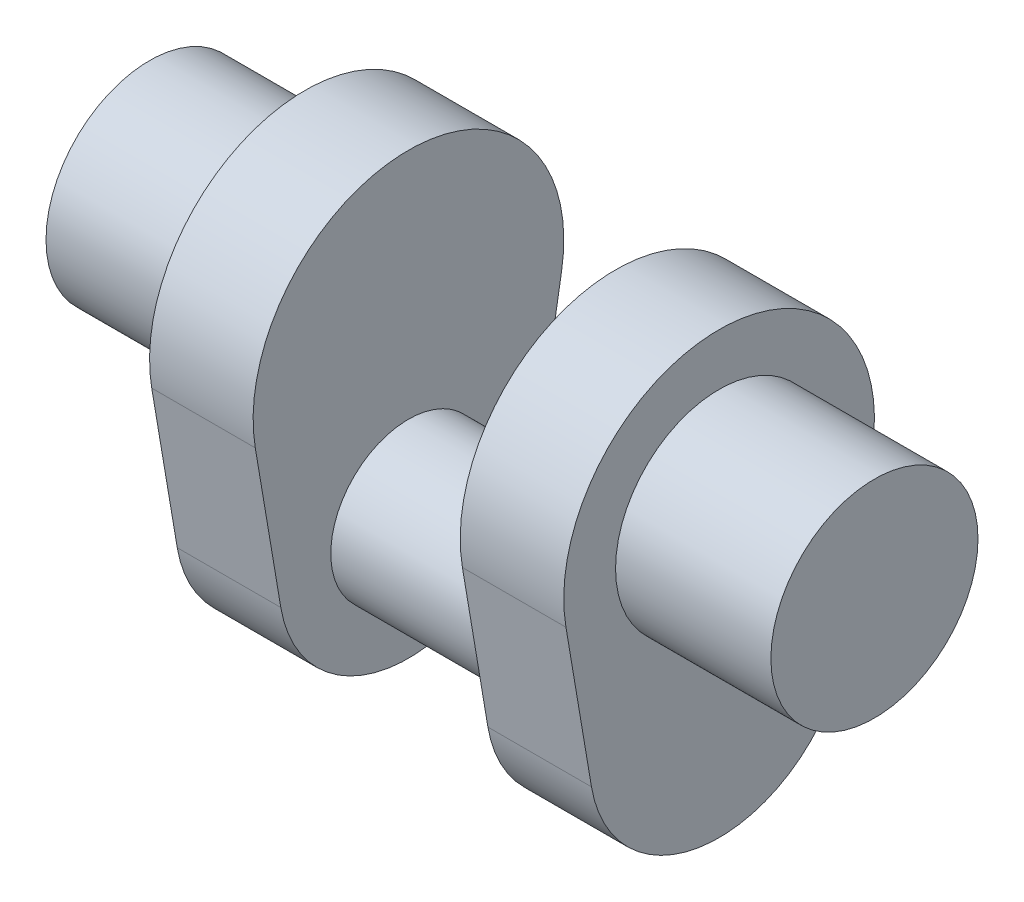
ISO-10303-21;
HEADER;
FILE_DESCRIPTION(('STEP AP214'),'2;1');
FILE_NAME('part.step','',(''),(''),'','','');
FILE_SCHEMA(('AUTOMOTIVE_DESIGN { 1 0 10303 214 1 1 1 1 }'));
ENDSEC;
DATA;
#1=APPLICATION_CONTEXT('core data for automotive mechanical design processes');
#2=APPLICATION_PROTOCOL_DEFINITION('international standard','automotive_design',2000,#1);
#3=PRODUCT_CONTEXT('',#1,'mechanical');
#4=PRODUCT('Part','Part','',(#3));
#5=PRODUCT_RELATED_PRODUCT_CATEGORY('part','',(#4));
#6=PRODUCT_DEFINITION_FORMATION('','',#4);
#7=PRODUCT_DEFINITION_CONTEXT('part definition',#1,'design');
#8=PRODUCT_DEFINITION('design','',#6,#7);
#9=PRODUCT_DEFINITION_SHAPE('','',#8);
#10=(LENGTH_UNIT() NAMED_UNIT(*) SI_UNIT(.MILLI.,.METRE.));
#11=(NAMED_UNIT(*) PLANE_ANGLE_UNIT() SI_UNIT($,.RADIAN.));
#12=(NAMED_UNIT(*) SI_UNIT($,.STERADIAN.) SOLID_ANGLE_UNIT());
#13=UNCERTAINTY_MEASURE_WITH_UNIT(LENGTH_MEASURE(1.E-05),#10,'distance_accuracy_value','');
#14=(GEOMETRIC_REPRESENTATION_CONTEXT(3) GLOBAL_UNCERTAINTY_ASSIGNED_CONTEXT((#13)) GLOBAL_UNIT_ASSIGNED_CONTEXT((#10,
#11,#12)) REPRESENTATION_CONTEXT('',''));
#15=CARTESIAN_POINT('',(0.,0.,0.));
#16=DIRECTION('',(0.,0.,1.));
#17=DIRECTION('',(1.,0.,0.));
#18=AXIS2_PLACEMENT_3D('',#15,#16,#17);
#19=CARTESIAN_POINT('',(20.,0.,0.));
#20=DIRECTION('',(-1.,0.,0.));
#21=DIRECTION('',(0.,0.,1.));
#22=AXIS2_PLACEMENT_3D('',#19,#20,#21);
#23=CYLINDRICAL_SURFACE('',#22,15.);
#24=CARTESIAN_POINT('',(20.,0.,0.));
#25=DIRECTION('',(1.,0.,0.));
#26=DIRECTION('',(0.,0.,-1.));
#27=AXIS2_PLACEMENT_3D('',#24,#25,#26);
#28=CIRCLE('',#27,15.);
#29=CARTESIAN_POINT('',(20.,0.,-15.));
#30=VERTEX_POINT('',#29);
#31=EDGE_CURVE('E41',#30,#30,#28,.T.);
#32=ORIENTED_EDGE('',*,*,#31,.F.);
#33=EDGE_LOOP('',(#32));
#34=FACE_BOUND('',#33,.T.);
#35=CARTESIAN_POINT('',(-20.,0.,0.));
#36=DIRECTION('',(1.,0.,0.));
#37=DIRECTION('',(0.,0.,-1.));
#38=AXIS2_PLACEMENT_3D('',#35,#36,#37);
#39=CIRCLE('',#38,15.);
#40=CARTESIAN_POINT('',(-20.,0.,-15.));
#41=VERTEX_POINT('',#40);
#42=EDGE_CURVE('E35',#41,#41,#39,.T.);
#43=ORIENTED_EDGE('',*,*,#42,.T.);
#44=EDGE_LOOP('',(#43));
#45=FACE_BOUND('',#44,.T.);
#46=ADVANCED_FACE('F32',(#34,#45),#23,.T.);
#47=CARTESIAN_POINT('',(40.,30.,0.));
#48=DIRECTION('',(-1.,0.,0.));
#49=DIRECTION('',(0.,0.,1.));
#50=AXIS2_PLACEMENT_3D('',#47,#48,#49);
#51=CYLINDRICAL_SURFACE('',#50,30.);
#52=CARTESIAN_POINT('',(20.,30.,0.));
#53=DIRECTION('',(1.,0.,0.));
#54=DIRECTION('',(0.,0.,-1.));
#55=AXIS2_PLACEMENT_3D('',#52,#53,#54);
#56=CIRCLE('',#55,30.);
#57=CARTESIAN_POINT('',(20.,25.,-29.5803989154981));
#58=VERTEX_POINT('',#57);
#59=CARTESIAN_POINT('',(20.,25.,29.5803989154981));
#60=VERTEX_POINT('',#59);
#61=EDGE_CURVE('E159',#58,#60,#56,.T.);
#62=ORIENTED_EDGE('',*,*,#61,.T.);
#63=DIRECTION('',(-1.,0.,0.));
#64=VECTOR('',#63,1.);
#65=CARTESIAN_POINT('',(40.,25.,29.5803989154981));
#66=LINE('',#65,#64);
#67=CARTESIAN_POINT('',(40.,25.,29.5803989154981));
#68=VERTEX_POINT('',#67);
#69=EDGE_CURVE('E171',#68,#60,#66,.T.);
#70=ORIENTED_EDGE('',*,*,#69,.F.);
#71=CARTESIAN_POINT('',(40.,30.,0.));
#72=DIRECTION('',(1.,0.,0.));
#73=DIRECTION('',(0.,0.,-1.));
#74=AXIS2_PLACEMENT_3D('',#71,#72,#73);
#75=CIRCLE('',#74,30.);
#76=CARTESIAN_POINT('',(40.,25.,-29.5803989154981));
#77=VERTEX_POINT('',#76);
#78=EDGE_CURVE('E152',#77,#68,#75,.T.);
#79=ORIENTED_EDGE('',*,*,#78,.F.);
#80=DIRECTION('',(-1.,0.,0.));
#81=VECTOR('',#80,1.);
#82=CARTESIAN_POINT('',(40.,25.,-29.5803989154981));
#83=LINE('',#82,#81);
#84=EDGE_CURVE('E158',#77,#58,#83,.T.);
#85=ORIENTED_EDGE('',*,*,#84,.T.);
#86=EDGE_LOOP('',(#62,#70,#79,#85));
#87=FACE_BOUND('',#86,.T.);
#88=ADVANCED_FACE('F180',(#87),#51,.T.);
#89=CARTESIAN_POINT('',(40.,25.,29.5803989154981));
#90=DIRECTION('',(0.,0.166666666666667,-0.986013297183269));
#91=DIRECTION('',(0.,0.986013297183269,0.166666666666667));
#92=AXIS2_PLACEMENT_3D('',#89,#90,#91);
#93=PLANE('',#92);
#94=DIRECTION('',(0.,-0.986013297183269,-0.166666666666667));
#95=VECTOR('',#94,1.);
#96=CARTESIAN_POINT('',(20.,25.,29.5803989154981));
#97=LINE('',#96,#95);
#98=CARTESIAN_POINT('',(20.,-4.16666666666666,24.6503324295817));
#99=VERTEX_POINT('',#98);
#100=EDGE_CURVE('E162',#60,#99,#97,.T.);
#101=ORIENTED_EDGE('',*,*,#100,.T.);
#102=DIRECTION('',(-1.,0.,0.));
#103=VECTOR('',#102,1.);
#104=CARTESIAN_POINT('',(40.,-4.16666666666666,24.6503324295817));
#105=LINE('',#104,#103);
#106=CARTESIAN_POINT('',(40.,-4.16666666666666,24.6503324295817));
#107=VERTEX_POINT('',#106);
#108=EDGE_CURVE('E169',#107,#99,#105,.T.);
#109=ORIENTED_EDGE('',*,*,#108,.F.);
#110=DIRECTION('',(0.,-0.986013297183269,-0.166666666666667));
#111=VECTOR('',#110,1.);
#112=CARTESIAN_POINT('',(40.,25.,29.5803989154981));
#113=LINE('',#112,#111);
#114=EDGE_CURVE('E82',#68,#107,#113,.T.);
#115=ORIENTED_EDGE('',*,*,#114,.F.);
#116=ORIENTED_EDGE('',*,*,#69,.T.);
#117=EDGE_LOOP('',(#101,#109,#115,#116));
#118=FACE_BOUND('',#117,.T.);
#119=ADVANCED_FACE('F218',(#118),#93,.F.);
#120=CARTESIAN_POINT('',(40.,0.,0.));
#121=DIRECTION('',(-1.,0.,0.));
#122=DIRECTION('',(0.,0.,1.));
#123=AXIS2_PLACEMENT_3D('',#120,#121,#122);
#124=CYLINDRICAL_SURFACE('',#123,25.);
#125=CARTESIAN_POINT('',(20.,0.,0.));
#126=DIRECTION('',(1.,0.,0.));
#127=DIRECTION('',(0.,0.,-1.));
#128=AXIS2_PLACEMENT_3D('',#125,#126,#127);
#129=CIRCLE('',#128,25.);
#130=CARTESIAN_POINT('',(20.,-4.16666666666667,-24.6503324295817));
#131=VERTEX_POINT('',#130);
#132=EDGE_CURVE('E68',#99,#131,#129,.T.);
#133=ORIENTED_EDGE('',*,*,#132,.T.);
#134=DIRECTION('',(-1.,0.,0.));
#135=VECTOR('',#134,1.);
#136=CARTESIAN_POINT('',(40.,-4.16666666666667,-24.6503324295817));
#137=LINE('',#136,#135);
#138=CARTESIAN_POINT('',(40.,-4.16666666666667,-24.6503324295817));
#139=VERTEX_POINT('',#138);
#140=EDGE_CURVE('E167',#139,#131,#137,.T.);
#141=ORIENTED_EDGE('',*,*,#140,.F.);
#142=CARTESIAN_POINT('',(40.,0.,0.));
#143=DIRECTION('',(1.,0.,0.));
#144=DIRECTION('',(0.,0.,-1.));
#145=AXIS2_PLACEMENT_3D('',#142,#143,#144);
#146=CIRCLE('',#145,25.);
#147=EDGE_CURVE('E155',#107,#139,#146,.T.);
#148=ORIENTED_EDGE('',*,*,#147,.F.);
#149=ORIENTED_EDGE('',*,*,#108,.T.);
#150=EDGE_LOOP('',(#133,#141,#148,#149));
#151=FACE_BOUND('',#150,.T.);
#152=ADVANCED_FACE('F215',(#151),#124,.T.);
#153=CARTESIAN_POINT('',(40.,25.,-29.5803989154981));
#154=DIRECTION('',(0.,0.166666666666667,0.986013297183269));
#155=DIRECTION('',(0.,-0.986013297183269,0.166666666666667));
#156=AXIS2_PLACEMENT_3D('',#153,#154,#155);
#157=PLANE('',#156);
#158=DIRECTION('',(0.,0.986013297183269,-0.166666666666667));
#159=VECTOR('',#158,1.);
#160=CARTESIAN_POINT('',(20.,25.,-29.5803989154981));
#161=LINE('',#160,#159);
#162=EDGE_CURVE('E74',#131,#58,#161,.T.);
#163=ORIENTED_EDGE('',*,*,#162,.T.);
#164=ORIENTED_EDGE('',*,*,#84,.F.);
#165=DIRECTION('',(0.,0.986013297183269,-0.166666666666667));
#166=VECTOR('',#165,1.);
#167=CARTESIAN_POINT('',(40.,25.,-29.5803989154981));
#168=LINE('',#167,#166);
#169=EDGE_CURVE('E50',#139,#77,#168,.T.);
#170=ORIENTED_EDGE('',*,*,#169,.F.);
#171=ORIENTED_EDGE('',*,*,#140,.T.);
#172=EDGE_LOOP('',(#163,#164,#170,#171));
#173=FACE_BOUND('',#172,.T.);
#174=ADVANCED_FACE('F209',(#173),#157,.F.);
#175=CARTESIAN_POINT('',(40.,30.,0.));
#176=DIRECTION('',(1.,0.,0.));
#177=DIRECTION('',(0.,0.,-1.));
#178=AXIS2_PLACEMENT_3D('',#175,#176,#177);
#179=PLANE('',#178);
#180=CARTESIAN_POINT('',(40.,30.,0.));
#181=DIRECTION('',(1.,0.,0.));
#182=DIRECTION('',(0.,0.,-1.));
#183=AXIS2_PLACEMENT_3D('',#180,#181,#182);
#184=CIRCLE('',#183,20.);
#185=CARTESIAN_POINT('',(40.,30.,-20.));
#186=VERTEX_POINT('',#185);
#187=EDGE_CURVE('E11',#186,#186,#184,.T.);
#188=ORIENTED_EDGE('',*,*,#187,.F.);
#189=EDGE_LOOP('',(#188));
#190=FACE_BOUND('',#189,.T.);
#191=ORIENTED_EDGE('',*,*,#78,.T.);
#192=ORIENTED_EDGE('',*,*,#114,.T.);
#193=ORIENTED_EDGE('',*,*,#147,.T.);
#194=ORIENTED_EDGE('',*,*,#169,.T.);
#195=EDGE_LOOP('',(#191,#192,#193,#194));
#196=FACE_BOUND('',#195,.T.);
#197=ADVANCED_FACE('F206',(#190,#196),#179,.T.);
#198=CARTESIAN_POINT('',(20.,30.,0.));
#199=DIRECTION('',(1.,0.,0.));
#200=DIRECTION('',(0.,0.,-1.));
#201=AXIS2_PLACEMENT_3D('',#198,#199,#200);
#202=PLANE('',#201);
#203=ORIENTED_EDGE('',*,*,#31,.T.);
#204=EDGE_LOOP('',(#203));
#205=FACE_BOUND('',#204,.T.);
#206=ORIENTED_EDGE('',*,*,#61,.F.);
#207=ORIENTED_EDGE('',*,*,#162,.F.);
#208=ORIENTED_EDGE('',*,*,#132,.F.);
#209=ORIENTED_EDGE('',*,*,#100,.F.);
#210=EDGE_LOOP('',(#206,#207,#208,#209));
#211=FACE_BOUND('',#210,.T.);
#212=ADVANCED_FACE('F175',(#205,#211),#202,.F.);
#213=CARTESIAN_POINT('',(-40.,30.,0.));
#214=DIRECTION('',(1.,0.,0.));
#215=DIRECTION('',(0.,0.,-1.));
#216=AXIS2_PLACEMENT_3D('',#213,#214,#215);
#217=CYLINDRICAL_SURFACE('',#216,30.);
#218=CARTESIAN_POINT('',(-20.,30.,0.));
#219=DIRECTION('',(1.,0.,0.));
#220=DIRECTION('',(0.,0.,-1.));
#221=AXIS2_PLACEMENT_3D('',#218,#219,#220);
#222=CIRCLE('',#221,30.);
#223=CARTESIAN_POINT('',(-20.,25.,-29.5803989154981));
#224=VERTEX_POINT('',#223);
#225=CARTESIAN_POINT('',(-20.,25.,29.5803989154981));
#226=VERTEX_POINT('',#225);
#227=EDGE_CURVE('E115',#224,#226,#222,.T.);
#228=ORIENTED_EDGE('',*,*,#227,.F.);
#229=DIRECTION('',(1.,0.,0.));
#230=VECTOR('',#229,1.);
#231=CARTESIAN_POINT('',(-40.,25.,-29.5803989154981));
#232=LINE('',#231,#230);
#233=CARTESIAN_POINT('',(-40.,25.,-29.5803989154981));
#234=VERTEX_POINT('',#233);
#235=EDGE_CURVE('E109',#234,#224,#232,.T.);
#236=ORIENTED_EDGE('',*,*,#235,.F.);
#237=CARTESIAN_POINT('',(-40.,30.,0.));
#238=DIRECTION('',(1.,0.,0.));
#239=DIRECTION('',(0.,0.,-1.));
#240=AXIS2_PLACEMENT_3D('',#237,#238,#239);
#241=CIRCLE('',#240,30.);
#242=CARTESIAN_POINT('',(-40.,25.,29.5803989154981));
#243=VERTEX_POINT('',#242);
#244=EDGE_CURVE('E112',#234,#243,#241,.T.);
#245=ORIENTED_EDGE('',*,*,#244,.T.);
#246=DIRECTION('',(1.,0.,0.));
#247=VECTOR('',#246,1.);
#248=CARTESIAN_POINT('',(-40.,25.,29.5803989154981));
#249=LINE('',#248,#247);
#250=EDGE_CURVE('E138',#243,#226,#249,.T.);
#251=ORIENTED_EDGE('',*,*,#250,.T.);
#252=EDGE_LOOP('',(#228,#236,#245,#251));
#253=FACE_BOUND('',#252,.T.);
#254=ADVANCED_FACE('F111',(#253),#217,.T.);
#255=CARTESIAN_POINT('',(-40.,25.,-29.5803989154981));
#256=DIRECTION('',(0.,-0.166666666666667,-0.986013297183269));
#257=DIRECTION('',(0.,0.986013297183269,-0.166666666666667));
#258=AXIS2_PLACEMENT_3D('',#255,#256,#257);
#259=PLANE('',#258);
#260=DIRECTION('',(0.,0.986013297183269,-0.166666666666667));
#261=VECTOR('',#260,1.);
#262=CARTESIAN_POINT('',(-20.,25.,-29.5803989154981));
#263=LINE('',#262,#261);
#264=CARTESIAN_POINT('',(-20.,-4.16666666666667,-24.6503324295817));
#265=VERTEX_POINT('',#264);
#266=EDGE_CURVE('E140',#265,#224,#263,.T.);
#267=ORIENTED_EDGE('',*,*,#266,.F.);
#268=DIRECTION('',(1.,0.,0.));
#269=VECTOR('',#268,1.);
#270=CARTESIAN_POINT('',(-40.,-4.16666666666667,-24.6503324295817));
#271=LINE('',#270,#269);
#272=CARTESIAN_POINT('',(-40.,-4.16666666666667,-24.6503324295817));
#273=VERTEX_POINT('',#272);
#274=EDGE_CURVE('E120',#273,#265,#271,.T.);
#275=ORIENTED_EDGE('',*,*,#274,.F.);
#276=DIRECTION('',(0.,0.986013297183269,-0.166666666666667));
#277=VECTOR('',#276,1.);
#278=CARTESIAN_POINT('',(-40.,25.,-29.5803989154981));
#279=LINE('',#278,#277);
#280=EDGE_CURVE('E126',#273,#234,#279,.T.);
#281=ORIENTED_EDGE('',*,*,#280,.T.);
#282=ORIENTED_EDGE('',*,*,#235,.T.);
#283=EDGE_LOOP('',(#267,#275,#281,#282));
#284=FACE_BOUND('',#283,.T.);
#285=ADVANCED_FACE('F132',(#284),#259,.T.);
#286=CARTESIAN_POINT('',(-40.,0.,0.));
#287=DIRECTION('',(1.,0.,0.));
#288=DIRECTION('',(0.,0.,-1.));
#289=AXIS2_PLACEMENT_3D('',#286,#287,#288);
#290=CYLINDRICAL_SURFACE('',#289,25.);
#291=CARTESIAN_POINT('',(-20.,0.,0.));
#292=DIRECTION('',(1.,0.,0.));
#293=DIRECTION('',(0.,0.,-1.));
#294=AXIS2_PLACEMENT_3D('',#291,#292,#293);
#295=CIRCLE('',#294,25.);
#296=CARTESIAN_POINT('',(-20.,-4.16666666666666,24.6503324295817));
#297=VERTEX_POINT('',#296);
#298=EDGE_CURVE('E143',#297,#265,#295,.T.);
#299=ORIENTED_EDGE('',*,*,#298,.F.);
#300=DIRECTION('',(1.,0.,0.));
#301=VECTOR('',#300,1.);
#302=CARTESIAN_POINT('',(-40.,-4.16666666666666,24.6503324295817));
#303=LINE('',#302,#301);
#304=CARTESIAN_POINT('',(-40.,-4.16666666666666,24.6503324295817));
#305=VERTEX_POINT('',#304);
#306=EDGE_CURVE('E149',#305,#297,#303,.T.);
#307=ORIENTED_EDGE('',*,*,#306,.F.);
#308=CARTESIAN_POINT('',(-40.,0.,0.));
#309=DIRECTION('',(1.,0.,0.));
#310=DIRECTION('',(0.,0.,-1.));
#311=AXIS2_PLACEMENT_3D('',#308,#309,#310);
#312=CIRCLE('',#311,25.);
#313=EDGE_CURVE('E133',#305,#273,#312,.T.);
#314=ORIENTED_EDGE('',*,*,#313,.T.);
#315=ORIENTED_EDGE('',*,*,#274,.T.);
#316=EDGE_LOOP('',(#299,#307,#314,#315));
#317=FACE_BOUND('',#316,.T.);
#318=ADVANCED_FACE('F194',(#317),#290,.T.);
#319=CARTESIAN_POINT('',(-40.,25.,29.5803989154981));
#320=DIRECTION('',(0.,-0.166666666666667,0.986013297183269));
#321=DIRECTION('',(0.,-0.986013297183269,-0.166666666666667));
#322=AXIS2_PLACEMENT_3D('',#319,#320,#321);
#323=PLANE('',#322);
#324=DIRECTION('',(0.,-0.986013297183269,-0.166666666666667));
#325=VECTOR('',#324,1.);
#326=CARTESIAN_POINT('',(-20.,25.,29.5803989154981));
#327=LINE('',#326,#325);
#328=EDGE_CURVE('E130',#226,#297,#327,.T.);
#329=ORIENTED_EDGE('',*,*,#328,.F.);
#330=ORIENTED_EDGE('',*,*,#250,.F.);
#331=DIRECTION('',(0.,-0.986013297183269,-0.166666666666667));
#332=VECTOR('',#331,1.);
#333=CARTESIAN_POINT('',(-40.,25.,29.5803989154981));
#334=LINE('',#333,#332);
#335=EDGE_CURVE('E129',#243,#305,#334,.T.);
#336=ORIENTED_EDGE('',*,*,#335,.T.);
#337=ORIENTED_EDGE('',*,*,#306,.T.);
#338=EDGE_LOOP('',(#329,#330,#336,#337));
#339=FACE_BOUND('',#338,.T.);
#340=ADVANCED_FACE('F191',(#339),#323,.T.);
#341=CARTESIAN_POINT('',(-40.,30.,0.));
#342=DIRECTION('',(-1.,0.,0.));
#343=DIRECTION('',(0.,0.,-1.));
#344=AXIS2_PLACEMENT_3D('',#341,#342,#343);
#345=PLANE('',#344);
#346=CARTESIAN_POINT('',(-40.,30.,0.));
#347=DIRECTION('',(1.,0.,0.));
#348=DIRECTION('',(0.,0.,-1.));
#349=AXIS2_PLACEMENT_3D('',#346,#347,#348);
#350=CIRCLE('',#349,20.);
#351=CARTESIAN_POINT('',(-40.,30.,-20.));
#352=VERTEX_POINT('',#351);
#353=EDGE_CURVE('E326',#352,#352,#350,.T.);
#354=ORIENTED_EDGE('',*,*,#353,.T.);
#355=EDGE_LOOP('',(#354));
#356=FACE_BOUND('',#355,.T.);
#357=ORIENTED_EDGE('',*,*,#244,.F.);
#358=ORIENTED_EDGE('',*,*,#280,.F.);
#359=ORIENTED_EDGE('',*,*,#313,.F.);
#360=ORIENTED_EDGE('',*,*,#335,.F.);
#361=EDGE_LOOP('',(#357,#358,#359,#360));
#362=FACE_BOUND('',#361,.T.);
#363=ADVANCED_FACE('F124',(#356,#362),#345,.T.);
#364=CARTESIAN_POINT('',(-20.,30.,0.));
#365=DIRECTION('',(-1.,0.,0.));
#366=DIRECTION('',(0.,0.,-1.));
#367=AXIS2_PLACEMENT_3D('',#364,#365,#366);
#368=PLANE('',#367);
#369=ORIENTED_EDGE('',*,*,#42,.F.);
#370=EDGE_LOOP('',(#369));
#371=FACE_BOUND('',#370,.T.);
#372=ORIENTED_EDGE('',*,*,#227,.T.);
#373=ORIENTED_EDGE('',*,*,#328,.T.);
#374=ORIENTED_EDGE('',*,*,#298,.T.);
#375=ORIENTED_EDGE('',*,*,#266,.T.);
#376=EDGE_LOOP('',(#372,#373,#374,#375));
#377=FACE_BOUND('',#376,.T.);
#378=ADVANCED_FACE('F184',(#371,#377),#368,.F.);
#379=CARTESIAN_POINT('',(70.,30.,0.));
#380=DIRECTION('',(-1.,0.,0.));
#381=DIRECTION('',(0.,0.,1.));
#382=AXIS2_PLACEMENT_3D('',#379,#380,#381);
#383=CYLINDRICAL_SURFACE('',#382,20.);
#384=CARTESIAN_POINT('',(70.,30.,0.));
#385=DIRECTION('',(1.,0.,0.));
#386=DIRECTION('',(0.,0.,-1.));
#387=AXIS2_PLACEMENT_3D('',#384,#385,#386);
#388=CIRCLE('',#387,20.);
#389=CARTESIAN_POINT('',(70.,30.,-20.));
#390=VERTEX_POINT('',#389);
#391=EDGE_CURVE('E141',#390,#390,#388,.T.);
#392=ORIENTED_EDGE('',*,*,#391,.F.);
#393=EDGE_LOOP('',(#392));
#394=FACE_BOUND('',#393,.T.);
#395=ORIENTED_EDGE('',*,*,#187,.T.);
#396=EDGE_LOOP('',(#395));
#397=FACE_BOUND('',#396,.T.);
#398=ADVANCED_FACE('F187',(#394,#397),#383,.T.);
#399=CARTESIAN_POINT('',(70.,30.,0.));
#400=DIRECTION('',(1.,0.,0.));
#401=DIRECTION('',(0.,0.,-1.));
#402=AXIS2_PLACEMENT_3D('',#399,#400,#401);
#403=PLANE('',#402);
#404=ORIENTED_EDGE('',*,*,#391,.T.);
#405=EDGE_LOOP('',(#404));
#406=FACE_BOUND('',#405,.T.);
#407=ADVANCED_FACE('F287',(#406),#403,.T.);
#408=CARTESIAN_POINT('',(-70.,30.,0.));
#409=DIRECTION('',(1.,0.,0.));
#410=DIRECTION('',(0.,0.,-1.));
#411=AXIS2_PLACEMENT_3D('',#408,#409,#410);
#412=CYLINDRICAL_SURFACE('',#411,20.);
#413=CARTESIAN_POINT('',(-70.,30.,0.));
#414=DIRECTION('',(1.,0.,0.));
#415=DIRECTION('',(0.,0.,-1.));
#416=AXIS2_PLACEMENT_3D('',#413,#414,#415);
#417=CIRCLE('',#416,20.);
#418=CARTESIAN_POINT('',(-70.,30.,-20.));
#419=VERTEX_POINT('',#418);
#420=EDGE_CURVE('E328',#419,#419,#417,.T.);
#421=ORIENTED_EDGE('',*,*,#420,.T.);
#422=EDGE_LOOP('',(#421));
#423=FACE_BOUND('',#422,.T.);
#424=ORIENTED_EDGE('',*,*,#353,.F.);
#425=EDGE_LOOP('',(#424));
#426=FACE_BOUND('',#425,.T.);
#427=ADVANCED_FACE('F294',(#423,#426),#412,.T.);
#428=CARTESIAN_POINT('',(-70.,30.,0.));
#429=DIRECTION('',(-1.,0.,0.));
#430=DIRECTION('',(0.,0.,-1.));
#431=AXIS2_PLACEMENT_3D('',#428,#429,#430);
#432=PLANE('',#431);
#433=ORIENTED_EDGE('',*,*,#420,.F.);
#434=EDGE_LOOP('',(#433));
#435=FACE_BOUND('',#434,.T.);
#436=ADVANCED_FACE('F302',(#435),#432,.T.);
#437=CLOSED_SHELL('',(#46,#88,#119,#152,#174,#197,#212,#254,#285,#318,#340,#363,#378,#398,#407,
#427,#436));
#438=MANIFOLD_SOLID_BREP('B2',#437);
#439=ADVANCED_BREP_SHAPE_REPRESENTATION('',(#18,#438),#14);
#440=SHAPE_DEFINITION_REPRESENTATION(#9,#439);
ENDSEC;
END-ISO-10303-21;
